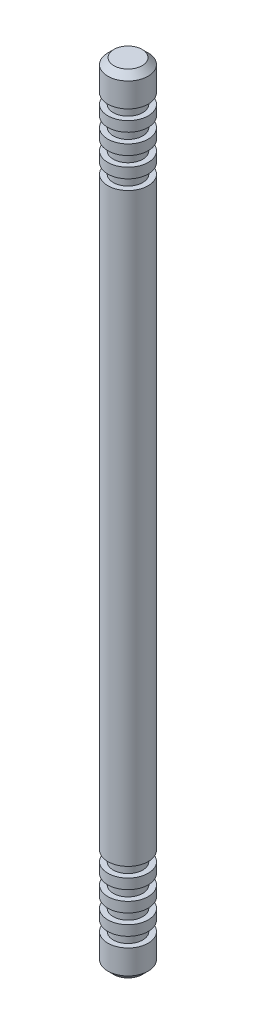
from build123d import *

# Parameters (mm, degrees)
CHANFREIN1_SIZE = 0.3


with BuildPart() as part:
    # Esquisse1 → R_volution1 (revolve)
    with BuildSketch(Plane.XY, mode=Mode.PRIVATE) as r_volution1_sk:
        Polygon((-26.092560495, -54.790002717), (-26.092560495, -56.290002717), (-25.822560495, -56.290002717), (-25.822560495, -56.790002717), (-26.092560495, -56.790002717), (-26.092560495, -57.290002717), (-25.822560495, -57.290002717), (-25.822560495, -57.790002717), (-26.092560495, -57.790002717), (-26.092560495, -58.290002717), (-25.822560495, -58.290002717), (-25.822560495, -58.790002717), (-26.092560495, -58.790002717), (-26.092560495, -59.290002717), (-25.822560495, -59.290002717), (-25.822560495, -59.790002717), (-26.092560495, -59.790002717), (-26.092560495, -88.790002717), (-25.822560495, -88.790002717), (-25.822560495, -89.290002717), (-26.092560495, -89.290002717), (-26.092560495, -89.790002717), (-25.822560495, -89.790002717), (-25.822560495, -90.290002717), (-26.092560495, -90.290002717), (-26.092560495, -90.790002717), (-25.822560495, -90.790002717), (-25.822560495, -91.290002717), (-26.092560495, -91.290002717), (-26.092560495, -91.790002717), (-25.822560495, -91.790002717), (-25.822560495, -92.290002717), (-26.092560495, -92.290002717), (-26.092560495, -93.790002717), (-25.092560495, -93.790002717), (-25.092560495, -54.790002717), align=None)
    revolve(r_volution1_sk.sketch.rotate(Axis((-25.092560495, -54.790002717, 0), (0, 1, 0)), 180), axis=Axis((-25.092560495, -54.790002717, 0), (0, 1, 0)))

    # Chanfrein1
    chanfrein1_edges = [part.edges().sort_by_distance(p)[0] for p in [
        (-26.092560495, -93.790002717, 0),
        (-26.092560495, -54.790002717, 0),
    ]]
    chamfer(chanfrein1_edges, length=CHANFREIN1_SIZE)


solid = part.part
